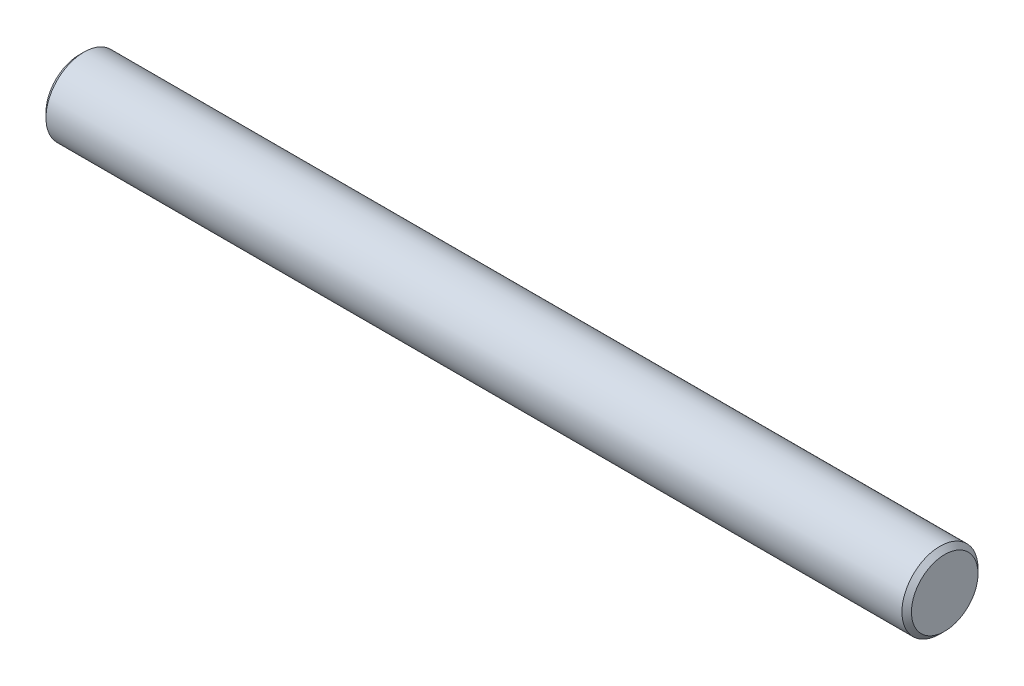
from build123d import *

# Parameters (mm, degrees)
SKETCH1_R      = 8
EXTRUDE1_DEPTH = 182
CHAMFER1_SIZE  = 1


with BuildPart() as part:
    # Sketch1 → Extrude1 (new body)
    with BuildSketch(Plane(origin=(0, 0, 0), x_dir=(0, 0, -1), z_dir=(1, 0, 0))):
        Circle(SKETCH1_R)
    extrude(amount=EXTRUDE1_DEPTH)

    # Chamfer1
    chamfer1_edges = [part.edges().sort_by_distance(p)[0] for p in [
        (0, 0, 8),
        (182, 0, 8),
    ]]
    chamfer(chamfer1_edges, length=CHAMFER1_SIZE)


solid = part.part
